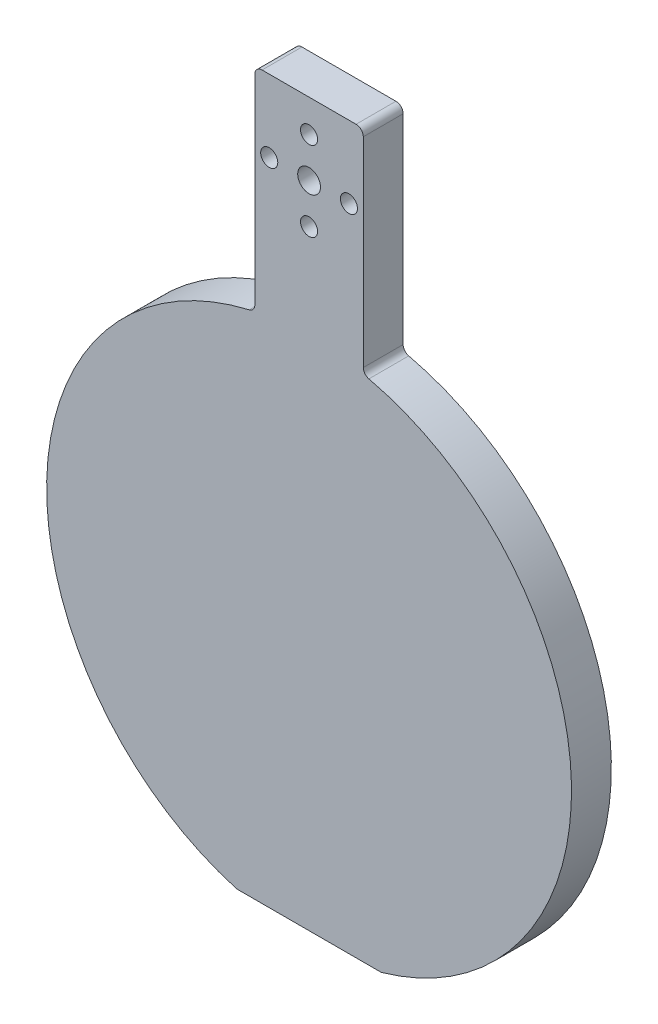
from build123d import *

# Parameters (mm, degrees)
BOSS_EXTRUDE1_DEPTH     = 7.000000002
CUT_EXTRUDE1_DEPTH      = 95.76577556
CUT_EXTRUDE1_DEPTH_BACK = 95.76577556
SKETCH2_R               = 2
SKETCH2_R_2             = 1.5
CUT_EXTRUDE2_DEPTH      = 95.76577556
CUT_EXTRUDE2_DEPTH_BACK = 95.76577556


with BuildPart() as part:
    # Sketch1 → Boss-Extrude1 (new body)
    with BuildSketch(Plane.XY):
        with BuildLine():
            Line((-9.525, 46.124609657), (-9.525, 81.2300001))
            ThreePointArc((-9.525, 81.2300001), (-9.153025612, 82.128025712), (-8.255, 82.5000001))
            Line((-8.255, 82.5000001), (8.255, 82.5000001))
            ThreePointArc((8.255, 82.5000001), (9.153025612, 82.128025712), (9.525, 81.2300001))
            Line((9.525, 81.2300001), (9.525, 46.124609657))
            ThreePointArc((9.525, 46.124609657), (9.799899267, 45.335512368), (10.505589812, 44.888024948))
            ThreePointArc((10.505589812, 44.888024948), (0, -46.101), (-10.505589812, 44.888024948))
            ThreePointArc((-10.505589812, 44.888024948), (-9.799899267, 45.335512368), (-9.525, 46.124609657))
        make_face()
    extrude(amount=BOSS_EXTRUDE1_DEPTH)

    # Sketch2 → Cut-Extrude1 (cut, two sides: drawn at the far end of the back side and taken through both)
    with BuildSketch(Plane.XY.offset(7.000000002).offset(-CUT_EXTRUDE1_DEPTH_BACK)):
        with Locations((0, 69.8000001)):
            Circle(SKETCH2_R)
        with Locations((0, 62.8000001)):
            Circle(SKETCH2_R_2)
        with Locations((0, 76.8000001)):
            Circle(SKETCH2_R_2)
        with Locations((7, 69.8000001)):
            Circle(SKETCH2_R_2)
        with Locations((-7, 69.8000001)):
            Circle(SKETCH2_R_2)
    extrude(amount=CUT_EXTRUDE1_DEPTH + CUT_EXTRUDE1_DEPTH_BACK, mode=Mode.SUBTRACT)

    # Sketch3 → Cut-Extrude2 (cut, two sides: drawn at the far end of the back side and taken through both)
    with BuildSketch(Plane.XY.offset(7.000000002).offset(-CUT_EXTRUDE2_DEPTH_BACK)):
        with BuildLine():
            Line((-12.7, -44.317177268), (12.7, -44.317177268))
            ThreePointArc((12.7, -44.317177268), (0, -46.101), (-12.7, -44.317177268))
        make_face()
    extrude(amount=CUT_EXTRUDE2_DEPTH + CUT_EXTRUDE2_DEPTH_BACK, mode=Mode.SUBTRACT)


solid = part.part
